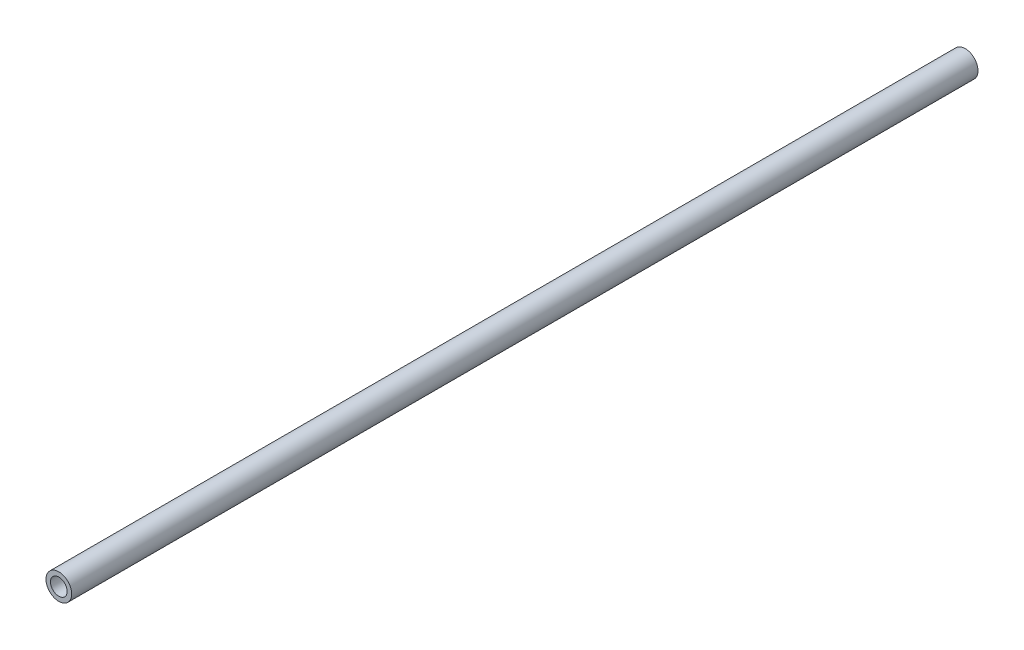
ISO-10303-21;
HEADER;
FILE_DESCRIPTION(('STEP AP214'),'2;1');
FILE_NAME('part.step','',(''),(''),'','','');
FILE_SCHEMA(('AUTOMOTIVE_DESIGN { 1 0 10303 214 1 1 1 1 }'));
ENDSEC;
DATA;
#1=APPLICATION_CONTEXT('core data for automotive mechanical design processes');
#2=APPLICATION_PROTOCOL_DEFINITION('international standard','automotive_design',2000,#1);
#3=PRODUCT_CONTEXT('',#1,'mechanical');
#4=PRODUCT('Part','Part','',(#3));
#5=PRODUCT_RELATED_PRODUCT_CATEGORY('part','',(#4));
#6=PRODUCT_DEFINITION_FORMATION('','',#4);
#7=PRODUCT_DEFINITION_CONTEXT('part definition',#1,'design');
#8=PRODUCT_DEFINITION('design','',#6,#7);
#9=PRODUCT_DEFINITION_SHAPE('','',#8);
#10=(LENGTH_UNIT() NAMED_UNIT(*) SI_UNIT(.MILLI.,.METRE.));
#11=(NAMED_UNIT(*) PLANE_ANGLE_UNIT() SI_UNIT($,.RADIAN.));
#12=(NAMED_UNIT(*) SI_UNIT($,.STERADIAN.) SOLID_ANGLE_UNIT());
#13=UNCERTAINTY_MEASURE_WITH_UNIT(LENGTH_MEASURE(1.E-05),#10,'distance_accuracy_value','');
#14=(GEOMETRIC_REPRESENTATION_CONTEXT(3) GLOBAL_UNCERTAINTY_ASSIGNED_CONTEXT((#13)) GLOBAL_UNIT_ASSIGNED_CONTEXT((#10,
#11,#12)) REPRESENTATION_CONTEXT('',''));
#15=CARTESIAN_POINT('',(0.,0.,0.));
#16=DIRECTION('',(0.,0.,1.));
#17=DIRECTION('',(1.,0.,0.));
#18=AXIS2_PLACEMENT_3D('',#15,#16,#17);
#19=CARTESIAN_POINT('',(0.,0.,70.6));
#20=DIRECTION('',(0.,0.,1.));
#21=DIRECTION('',(1.,0.,0.));
#22=AXIS2_PLACEMENT_3D('',#19,#20,#21);
#23=PLANE('',#22);
#24=CARTESIAN_POINT('',(0.,0.,70.6));
#25=DIRECTION('',(0.,0.,1.));
#26=DIRECTION('',(1.,0.,0.));
#27=AXIS2_PLACEMENT_3D('',#24,#25,#26);
#28=CIRCLE('',#27,1.);
#29=CARTESIAN_POINT('',(1.,0.,70.6));
#30=VERTEX_POINT('',#29);
#31=EDGE_CURVE('E10',#30,#30,#28,.T.);
#32=ORIENTED_EDGE('',*,*,#31,.T.);
#33=EDGE_LOOP('',(#32));
#34=FACE_BOUND('',#33,.T.);
#35=CARTESIAN_POINT('',(0.,0.,70.6));
#36=DIRECTION('',(0.,0.,1.));
#37=DIRECTION('',(1.,0.,0.));
#38=AXIS2_PLACEMENT_3D('',#35,#36,#37);
#39=CIRCLE('',#38,0.65);
#40=CARTESIAN_POINT('',(0.65,0.,70.6));
#41=VERTEX_POINT('',#40);
#42=EDGE_CURVE('E40',#41,#41,#39,.T.);
#43=ORIENTED_EDGE('',*,*,#42,.F.);
#44=EDGE_LOOP('',(#43));
#45=FACE_BOUND('',#44,.T.);
#46=ADVANCED_FACE('F29',(#34,#45),#23,.T.);
#47=CARTESIAN_POINT('',(0.,0.,0.));
#48=DIRECTION('',(0.,0.,1.));
#49=DIRECTION('',(1.,0.,0.));
#50=AXIS2_PLACEMENT_3D('',#47,#48,#49);
#51=PLANE('',#50);
#52=CARTESIAN_POINT('',(0.,0.,0.));
#53=DIRECTION('',(0.,0.,1.));
#54=DIRECTION('',(1.,0.,0.));
#55=AXIS2_PLACEMENT_3D('',#52,#53,#54);
#56=CIRCLE('',#55,1.);
#57=CARTESIAN_POINT('',(1.,0.,0.));
#58=VERTEX_POINT('',#57);
#59=EDGE_CURVE('E33',#58,#58,#56,.T.);
#60=ORIENTED_EDGE('',*,*,#59,.F.);
#61=EDGE_LOOP('',(#60));
#62=FACE_BOUND('',#61,.T.);
#63=CARTESIAN_POINT('',(0.,0.,0.));
#64=DIRECTION('',(0.,0.,1.));
#65=DIRECTION('',(1.,0.,0.));
#66=AXIS2_PLACEMENT_3D('',#63,#64,#65);
#67=CIRCLE('',#66,0.65);
#68=CARTESIAN_POINT('',(0.65,0.,0.));
#69=VERTEX_POINT('',#68);
#70=EDGE_CURVE('E42',#69,#69,#67,.T.);
#71=ORIENTED_EDGE('',*,*,#70,.T.);
#72=EDGE_LOOP('',(#71));
#73=FACE_BOUND('',#72,.T.);
#74=ADVANCED_FACE('F52',(#62,#73),#51,.F.);
#75=CARTESIAN_POINT('',(0.,0.,70.6));
#76=DIRECTION('',(0.,0.,-1.));
#77=DIRECTION('',(-1.,0.,0.));
#78=AXIS2_PLACEMENT_3D('',#75,#76,#77);
#79=CYLINDRICAL_SURFACE('',#78,1.);
#80=ORIENTED_EDGE('',*,*,#31,.F.);
#81=EDGE_LOOP('',(#80));
#82=FACE_BOUND('',#81,.T.);
#83=ORIENTED_EDGE('',*,*,#59,.T.);
#84=EDGE_LOOP('',(#83));
#85=FACE_BOUND('',#84,.T.);
#86=ADVANCED_FACE('F31',(#82,#85),#79,.T.);
#87=CARTESIAN_POINT('',(0.,0.,70.6));
#88=DIRECTION('',(0.,0.,-1.));
#89=DIRECTION('',(-1.,0.,0.));
#90=AXIS2_PLACEMENT_3D('',#87,#88,#89);
#91=CYLINDRICAL_SURFACE('',#90,0.65);
#92=ORIENTED_EDGE('',*,*,#42,.T.);
#93=EDGE_LOOP('',(#92));
#94=FACE_BOUND('',#93,.T.);
#95=ORIENTED_EDGE('',*,*,#70,.F.);
#96=EDGE_LOOP('',(#95));
#97=FACE_BOUND('',#96,.T.);
#98=ADVANCED_FACE('F48',(#94,#97),#91,.F.);
#99=CLOSED_SHELL('',(#46,#74,#86,#98));
#100=MANIFOLD_SOLID_BREP('B2',#99);
#101=ADVANCED_BREP_SHAPE_REPRESENTATION('',(#18,#100),#14);
#102=SHAPE_DEFINITION_REPRESENTATION(#9,#101);
ENDSEC;
END-ISO-10303-21;
